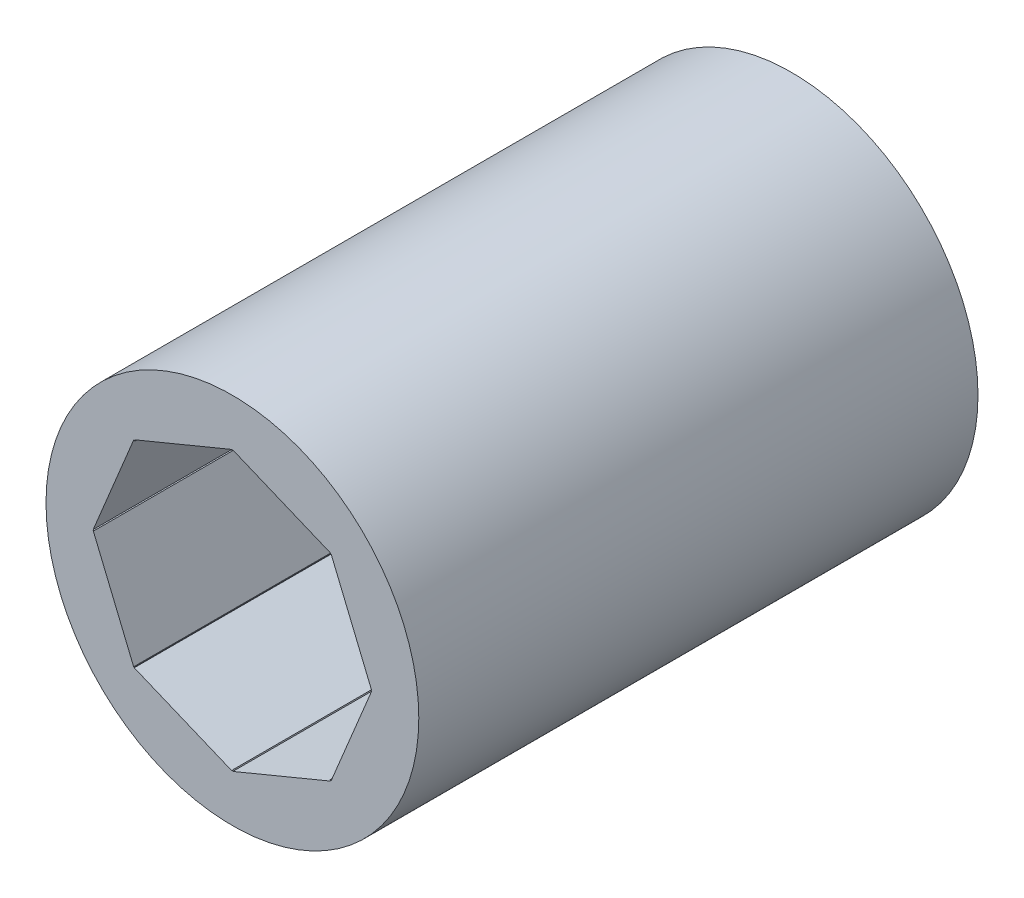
from build123d import *

# Parameters (mm, degrees)
SKIZZE1_R                       = 10
SKIZZE1_R_2                     = 5
LINEAR_AUSTRAGEN1_DEPTH         = 30
SCHNITT_LINEAR_AUSTRAGEN1_DEPTH = 30
KREISMUSTER1_COUNT              = 8
SCHNITT_LINEAR_AUSTRAGEN4_DEPTH = 15
SCHNITT_LINEAR_AUSTRAGEN3_DEPTH = 2
KREISMUSTER5_COUNT              = 8


with BuildPart() as part:
    # Skizze1 → Linear austragen1 (new body)
    with BuildSketch(Plane.XY):
        Circle(SKIZZE1_R)
        Circle(SKIZZE1_R_2, mode=Mode.SUBTRACT)
    extrude(amount=-LINEAR_AUSTRAGEN1_DEPTH)

    # Skizze1_3 → Schnitt-Linear austragen1 (cut)
    with BuildSketch(Plane.XY):
        with BuildLine():
            Line((1, 7), (-1, 7))
            Line((-1, 7), (-1, 4.898979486))
            ThreePointArc((-1, 4.898979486), (0, 5), (1, 4.898979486))
            Line((1, 4.898979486), (1, 7))
        make_face()
    schnitt_linear_austragen1 = extrude(amount=-SCHNITT_LINEAR_AUSTRAGEN1_DEPTH, mode=Mode.SUBTRACT)

    # Kreismuster1: Schnitt-Linear austragen1 ×8 about axis
    kreismuster1_axis = Axis((0, 0, 0), (0, 0, 1))
    for i in range(1, KREISMUSTER1_COUNT):
        add(schnitt_linear_austragen1.rotate(kreismuster1_axis, i * 360 / KREISMUSTER1_COUNT), mode=Mode.SUBTRACT)

    # Skizze6 → Schnitt-Linear austragen4 (cut)
    with BuildSketch(Plane.XY):
        Polygon((-7.414213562, 0), (-5.242640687, -5.242640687), (0, -7.414213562), (5.242640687, -5.242640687), (7.414213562, 0), (5.242640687, 5.242640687), (0, 7.414213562), (-5.242640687, 5.242640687), align=None)
    extrude(amount=-SCHNITT_LINEAR_AUSTRAGEN4_DEPTH, mode=Mode.SUBTRACT)

    # Skizze5 → Schnitt-Linear austragen3 (cut)
    with BuildSketch(Plane(origin=(-4.535093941, 1.878497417, 0), x_dir=(0, 0, -1), z_dir=(0.9238795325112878, -0.38268343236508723, 0))):
        Polygon((20.674593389, 2.837296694), (15, -2.837296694), (0, -2.837296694), (0, 2.837296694), align=None)
    schnitt_linear_austragen3 = extrude(amount=-SCHNITT_LINEAR_AUSTRAGEN3_DEPTH, mode=Mode.SUBTRACT)

    # Kreismuster5: Schnitt-Linear austragen3 ×8 about axis
    kreismuster5_axis = Axis((0, 0, 0), (0, 0, 1))
    for i in range(1, KREISMUSTER5_COUNT):
        add(schnitt_linear_austragen3.rotate(kreismuster5_axis, i * 360 / KREISMUSTER5_COUNT), mode=Mode.SUBTRACT)


solid = part.part
